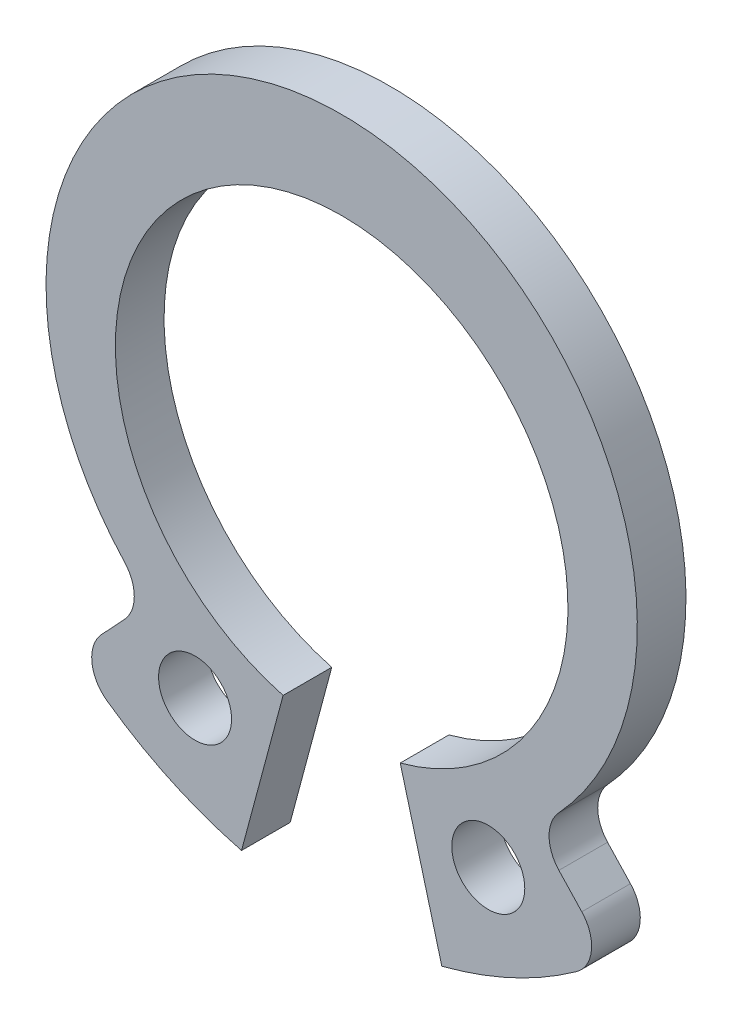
from build123d import *

# Parameters (mm, degrees)
ESQUISSE1_R          = 0.75
BASE_EXTRUSION_DEPTH = 1


with BuildPart() as part:
    # Esquisse1 → Base-Extrusion (new body)
    with BuildSketch(Plane.XY):
        with BuildLine():
            Line((4.463786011, -4.770586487), (4.934152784, -5.273282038))
            ThreePointArc((4.934152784, -5.273282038), (5.132763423, -5.86053518), (4.82151402, -6.396665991))
            ThreePointArc((4.82151402, -6.396665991), (3.498822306, -7.165603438), (2.057611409, -7.679110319))
            Line((2.057611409, -7.679110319), (1.20350856, -4.491555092))
            ThreePointArc((1.20350856, -4.491555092), (0, 4.65), (-1.20350856, -4.491555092))
            Line((-1.20350856, -4.491555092), (-2.057611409, -7.679110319))
            ThreePointArc((-2.057611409, -7.679110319), (-3.498822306, -7.165603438), (-4.82151402, -6.396665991))
            ThreePointArc((-4.82151402, -6.396665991), (-5.132763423, -5.86053518), (-4.934152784, -5.273282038))
            Line((-4.934152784, -5.273282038), (-4.463786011, -4.770586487))
            ThreePointArc((-4.463786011, -4.770586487), (-4.261436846, -4.260404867), (-4.460726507, -3.749020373))
            ThreePointArc((-4.460726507, -3.749020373), (0, 6.45), (4.460726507, -3.749020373))
            ThreePointArc((4.460726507, -3.749020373), (4.261436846, -4.260404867), (4.463786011, -4.770586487))
        make_face()
        with Locations((3.01251129, -5.444110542)):
            Circle(ESQUISSE1_R, mode=Mode.SUBTRACT)
        with Locations(Location((-3.01251129, -5.444110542, 0), (0, 0, 180))):
            Circle(ESQUISSE1_R, mode=Mode.SUBTRACT)
    extrude(amount=BASE_EXTRUSION_DEPTH)


solid = part.part
